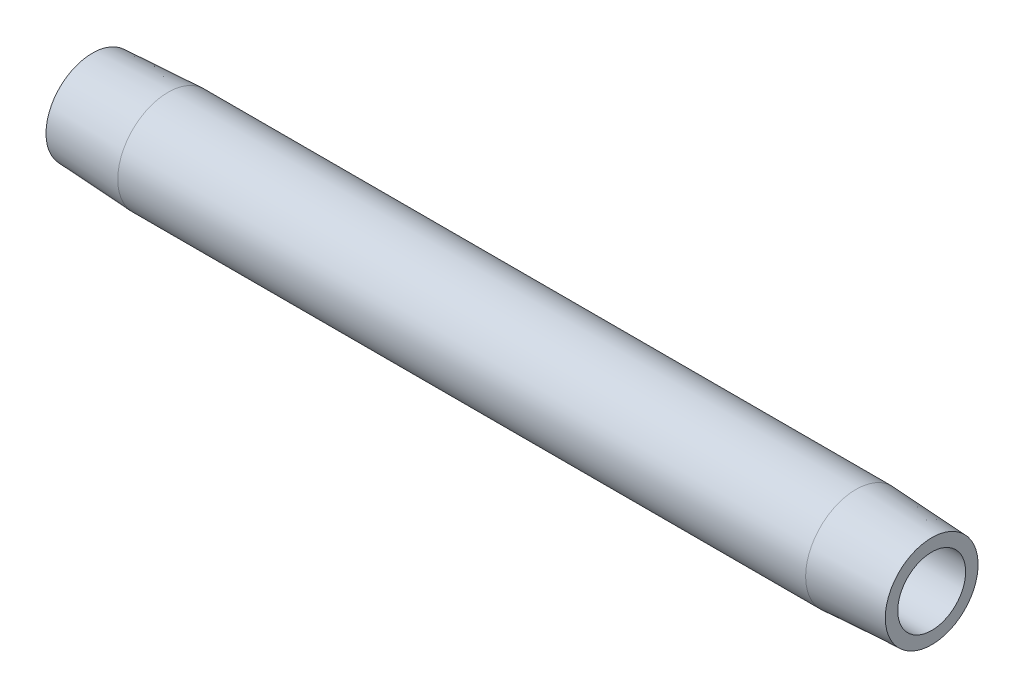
ISO-10303-21;
HEADER;
FILE_DESCRIPTION(('STEP AP214'),'2;1');
FILE_NAME('part.step','',(''),(''),'','','');
FILE_SCHEMA(('AUTOMOTIVE_DESIGN { 1 0 10303 214 1 1 1 1 }'));
ENDSEC;
DATA;
#1=APPLICATION_CONTEXT('core data for automotive mechanical design processes');
#2=APPLICATION_PROTOCOL_DEFINITION('international standard','automotive_design',2000,#1);
#3=PRODUCT_CONTEXT('',#1,'mechanical');
#4=PRODUCT('Part','Part','',(#3));
#5=PRODUCT_RELATED_PRODUCT_CATEGORY('part','',(#4));
#6=PRODUCT_DEFINITION_FORMATION('','',#4);
#7=PRODUCT_DEFINITION_CONTEXT('part definition',#1,'design');
#8=PRODUCT_DEFINITION('design','',#6,#7);
#9=PRODUCT_DEFINITION_SHAPE('','',#8);
#10=(LENGTH_UNIT() NAMED_UNIT(*) SI_UNIT(.MILLI.,.METRE.));
#11=(NAMED_UNIT(*) PLANE_ANGLE_UNIT() SI_UNIT($,.RADIAN.));
#12=(NAMED_UNIT(*) SI_UNIT($,.STERADIAN.) SOLID_ANGLE_UNIT());
#13=UNCERTAINTY_MEASURE_WITH_UNIT(LENGTH_MEASURE(1.E-05),#10,'distance_accuracy_value','');
#14=(GEOMETRIC_REPRESENTATION_CONTEXT(3) GLOBAL_UNCERTAINTY_ASSIGNED_CONTEXT((#13)) GLOBAL_UNIT_ASSIGNED_CONTEXT((#10,
#11,#12)) REPRESENTATION_CONTEXT('',''));
#15=CARTESIAN_POINT('',(0.,0.,0.));
#16=DIRECTION('',(0.,0.,1.));
#17=DIRECTION('',(1.,0.,0.));
#18=AXIS2_PLACEMENT_3D('',#15,#16,#17);
#19=CARTESIAN_POINT('',(114.3,0.,-4.62277681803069));
#20=DIRECTION('',(-1.,0.,0.));
#21=DIRECTION('',(0.,0.,1.));
#22=AXIS2_PLACEMENT_3D('',#19,#20,#21);
#23=PLANE('',#22);
#24=CARTESIAN_POINT('',(114.3,0.,0.));
#25=DIRECTION('',(-1.,0.,0.));
#26=DIRECTION('',(0.,0.,1.));
#27=AXIS2_PLACEMENT_3D('',#24,#25,#26);
#28=CIRCLE('',#27,6.31752683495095);
#29=CARTESIAN_POINT('',(114.3,0.,6.31752683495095));
#30=VERTEX_POINT('',#29);
#31=EDGE_CURVE('E10',#30,#30,#28,.T.);
#32=ORIENTED_EDGE('',*,*,#31,.F.);
#33=EDGE_LOOP('',(#32));
#34=FACE_BOUND('',#33,.T.);
#35=CARTESIAN_POINT('',(114.3,0.,0.));
#36=DIRECTION('',(-1.,0.,0.));
#37=DIRECTION('',(0.,0.,1.));
#38=AXIS2_PLACEMENT_3D('',#35,#36,#37);
#39=CIRCLE('',#38,4.62277681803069);
#40=CARTESIAN_POINT('',(114.3,0.,4.62277681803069));
#41=VERTEX_POINT('',#40);
#42=EDGE_CURVE('E52',#41,#41,#39,.T.);
#43=ORIENTED_EDGE('',*,*,#42,.T.);
#44=EDGE_LOOP('',(#43));
#45=FACE_BOUND('',#44,.T.);
#46=ADVANCED_FACE('F30',(#34,#45),#23,.F.);
#47=CARTESIAN_POINT('',(114.3,0.,0.));
#48=DIRECTION('',(-1.,0.,0.));
#49=DIRECTION('',(0.,0.,1.));
#50=AXIS2_PLACEMENT_3D('',#47,#48,#49);
#51=CONICAL_SURFACE('',#50,6.31752683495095,0.052359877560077);
#52=CARTESIAN_POINT('',(103.987600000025,0.,0.));
#53=DIRECTION('',(-1.,0.,0.));
#54=DIRECTION('',(0.,0.,1.));
#55=AXIS2_PLACEMENT_3D('',#52,#53,#54);
#56=CIRCLE('',#55,6.85797681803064);
#57=CARTESIAN_POINT('',(103.987600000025,0.,6.85797681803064));
#58=VERTEX_POINT('',#57);
#59=EDGE_CURVE('E36',#58,#58,#56,.T.);
#60=ORIENTED_EDGE('',*,*,#59,.F.);
#61=EDGE_LOOP('',(#60));
#62=FACE_BOUND('',#61,.T.);
#63=ORIENTED_EDGE('',*,*,#31,.T.);
#64=EDGE_LOOP('',(#63));
#65=FACE_BOUND('',#64,.T.);
#66=ADVANCED_FACE('F77',(#62,#65),#51,.T.);
#67=CARTESIAN_POINT('',(-6.37599469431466,0.,0.));
#68=DIRECTION('',(-1.,0.,0.));
#69=DIRECTION('',(0.,0.,1.));
#70=AXIS2_PLACEMENT_3D('',#67,#68,#69);
#71=CYLINDRICAL_SURFACE('',#70,6.85797681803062);
#72=CARTESIAN_POINT('',(10.3123999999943,0.,0.));
#73=DIRECTION('',(-1.,0.,0.));
#74=DIRECTION('',(0.,0.,1.));
#75=AXIS2_PLACEMENT_3D('',#72,#73,#74);
#76=CIRCLE('',#75,6.8579768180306);
#77=CARTESIAN_POINT('',(10.3123999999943,0.,6.8579768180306));
#78=VERTEX_POINT('',#77);
#79=EDGE_CURVE('E40',#78,#78,#76,.T.);
#80=ORIENTED_EDGE('',*,*,#79,.F.);
#81=EDGE_LOOP('',(#80));
#82=FACE_BOUND('',#81,.T.);
#83=ORIENTED_EDGE('',*,*,#59,.T.);
#84=EDGE_LOOP('',(#83));
#85=FACE_BOUND('',#84,.T.);
#86=ADVANCED_FACE('F72',(#82,#85),#71,.T.);
#87=CARTESIAN_POINT('',(10.3123999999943,0.,0.));
#88=DIRECTION('',(1.,0.,0.));
#89=DIRECTION('',(0.,0.,-1.));
#90=AXIS2_PLACEMENT_3D('',#87,#88,#89);
#91=CONICAL_SURFACE('',#90,6.8579768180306,0.0523598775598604);
#92=CARTESIAN_POINT('',(1.90819582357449E-11,0.,0.));
#93=DIRECTION('',(-1.,0.,0.));
#94=DIRECTION('',(0.,0.,1.));
#95=AXIS2_PLACEMENT_3D('',#92,#93,#94);
#96=CIRCLE('',#95,6.31752683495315);
#97=CARTESIAN_POINT('',(1.90819582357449E-11,0.,6.31752683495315));
#98=VERTEX_POINT('',#97);
#99=EDGE_CURVE('E44',#98,#98,#96,.T.);
#100=ORIENTED_EDGE('',*,*,#99,.F.);
#101=EDGE_LOOP('',(#100));
#102=FACE_BOUND('',#101,.T.);
#103=ORIENTED_EDGE('',*,*,#79,.T.);
#104=EDGE_LOOP('',(#103));
#105=FACE_BOUND('',#104,.T.);
#106=ADVANCED_FACE('F66',(#102,#105),#91,.T.);
#107=CARTESIAN_POINT('',(1.90819582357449E-11,0.,-6.31752683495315));
#108=DIRECTION('',(1.,0.,0.));
#109=DIRECTION('',(0.,0.,-1.));
#110=AXIS2_PLACEMENT_3D('',#107,#108,#109);
#111=PLANE('',#110);
#112=CARTESIAN_POINT('',(1.90819582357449E-11,0.,0.));
#113=DIRECTION('',(-1.,0.,0.));
#114=DIRECTION('',(0.,0.,1.));
#115=AXIS2_PLACEMENT_3D('',#112,#113,#114);
#116=CIRCLE('',#115,4.62277681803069);
#117=CARTESIAN_POINT('',(1.90819582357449E-11,0.,4.62277681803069));
#118=VERTEX_POINT('',#117);
#119=EDGE_CURVE('E49',#118,#118,#116,.T.);
#120=ORIENTED_EDGE('',*,*,#119,.F.);
#121=EDGE_LOOP('',(#120));
#122=FACE_BOUND('',#121,.T.);
#123=ORIENTED_EDGE('',*,*,#99,.T.);
#124=EDGE_LOOP('',(#123));
#125=FACE_BOUND('',#124,.T.);
#126=ADVANCED_FACE('F60',(#122,#125),#111,.F.);
#127=CARTESIAN_POINT('',(-6.37599469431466,0.,0.));
#128=DIRECTION('',(-1.,0.,0.));
#129=DIRECTION('',(0.,0.,1.));
#130=AXIS2_PLACEMENT_3D('',#127,#128,#129);
#131=CYLINDRICAL_SURFACE('',#130,4.62277681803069);
#132=ORIENTED_EDGE('',*,*,#42,.F.);
#133=EDGE_LOOP('',(#132));
#134=FACE_BOUND('',#133,.T.);
#135=ORIENTED_EDGE('',*,*,#119,.T.);
#136=EDGE_LOOP('',(#135));
#137=FACE_BOUND('',#136,.T.);
#138=ADVANCED_FACE('F57',(#134,#137),#131,.F.);
#139=CLOSED_SHELL('',(#46,#66,#86,#106,#126,#138));
#140=MANIFOLD_SOLID_BREP('B2',#139);
#141=ADVANCED_BREP_SHAPE_REPRESENTATION('',(#18,#140),#14);
#142=SHAPE_DEFINITION_REPRESENTATION(#9,#141);
ENDSEC;
END-ISO-10303-21;
